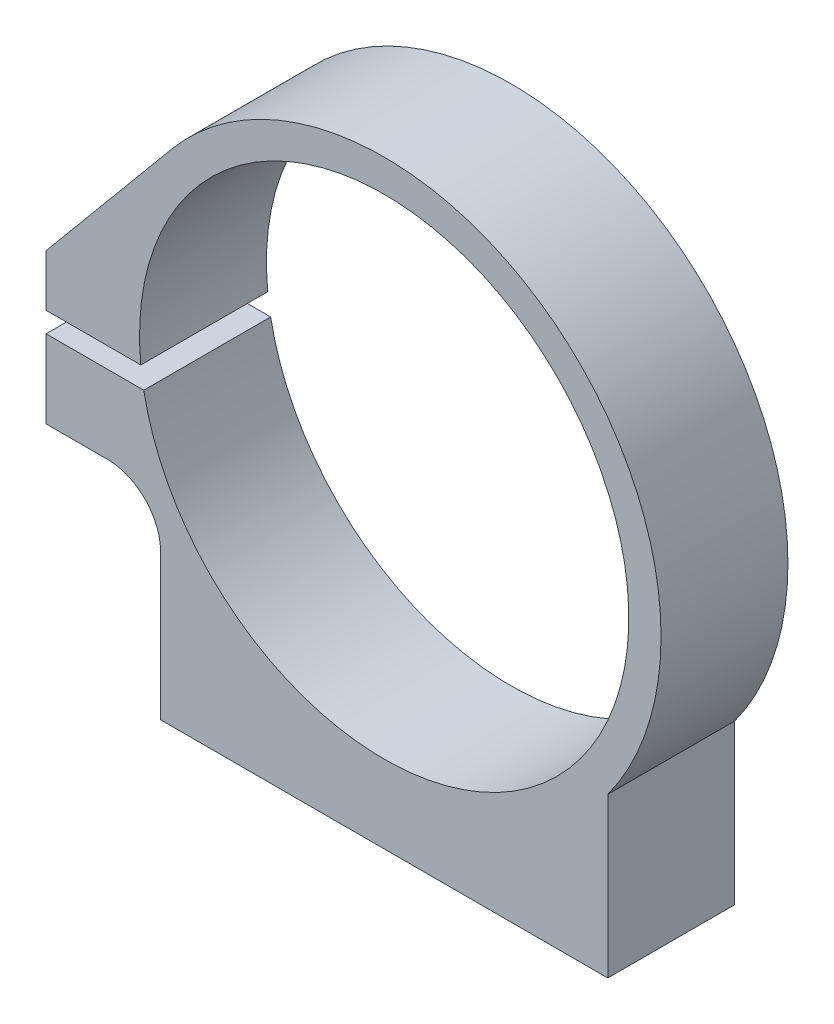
ISO-10303-21;
HEADER;
FILE_DESCRIPTION(('STEP AP214'),'2;1');
FILE_NAME('part.step','',(''),(''),'','','');
FILE_SCHEMA(('AUTOMOTIVE_DESIGN { 1 0 10303 214 1 1 1 1 }'));
ENDSEC;
DATA;
#1=APPLICATION_CONTEXT('core data for automotive mechanical design processes');
#2=APPLICATION_PROTOCOL_DEFINITION('international standard','automotive_design',2000,#1);
#3=PRODUCT_CONTEXT('',#1,'mechanical');
#4=PRODUCT('Part','Part','',(#3));
#5=PRODUCT_RELATED_PRODUCT_CATEGORY('part','',(#4));
#6=PRODUCT_DEFINITION_FORMATION('','',#4);
#7=PRODUCT_DEFINITION_CONTEXT('part definition',#1,'design');
#8=PRODUCT_DEFINITION('design','',#6,#7);
#9=PRODUCT_DEFINITION_SHAPE('','',#8);
#10=(LENGTH_UNIT() NAMED_UNIT(*) SI_UNIT(.MILLI.,.METRE.));
#11=(NAMED_UNIT(*) PLANE_ANGLE_UNIT() SI_UNIT($,.RADIAN.));
#12=(NAMED_UNIT(*) SI_UNIT($,.STERADIAN.) SOLID_ANGLE_UNIT());
#13=UNCERTAINTY_MEASURE_WITH_UNIT(LENGTH_MEASURE(1.E-05),#10,'distance_accuracy_value','');
#14=(GEOMETRIC_REPRESENTATION_CONTEXT(3) GLOBAL_UNCERTAINTY_ASSIGNED_CONTEXT((#13)) GLOBAL_UNIT_ASSIGNED_CONTEXT((#10,
#11,#12)) REPRESENTATION_CONTEXT('',''));
#15=CARTESIAN_POINT('',(0.,0.,0.));
#16=DIRECTION('',(0.,0.,1.));
#17=DIRECTION('',(1.,0.,0.));
#18=AXIS2_PLACEMENT_3D('',#15,#16,#17);
#19=CARTESIAN_POINT('',(-8.60422844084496E-13,-3.60822483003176E-13,50.8312898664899));
#20=DIRECTION('',(0.,0.,1.));
#21=DIRECTION('',(1.,0.,0.));
#22=AXIS2_PLACEMENT_3D('',#19,#20,#21);
#23=CYLINDRICAL_SURFACE('',#22,20.7264);
#24=CARTESIAN_POINT('',(-8.60422844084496E-13,-3.60822483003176E-13,60.3308898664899));
#25=DIRECTION('',(0.,0.,1.));
#26=DIRECTION('',(-1.,0.,0.));
#27=AXIS2_PLACEMENT_3D('',#24,#25,#26);
#28=CIRCLE('',#27,20.7264);
#29=CARTESIAN_POINT('',(16.7386,-12.2230490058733,60.3308898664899));
#30=VERTEX_POINT('',#29);
#31=CARTESIAN_POINT('',(-15.9273549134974,13.2628436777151,60.3308898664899));
#32=VERTEX_POINT('',#31);
#33=EDGE_CURVE('E156',#30,#32,#28,.T.);
#34=ORIENTED_EDGE('',*,*,#33,.F.);
#35=DIRECTION('',(0.,0.,1.));
#36=VECTOR('',#35,1.);
#37=CARTESIAN_POINT('',(16.7386,-12.2230490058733,50.8312898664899));
#38=LINE('',#37,#36);
#39=CARTESIAN_POINT('',(16.7386,-12.2230490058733,50.8312898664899));
#40=VERTEX_POINT('',#39);
#41=EDGE_CURVE('E11',#40,#30,#38,.T.);
#42=ORIENTED_EDGE('',*,*,#41,.F.);
#43=CARTESIAN_POINT('',(-8.60422844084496E-13,-3.60822483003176E-13,50.8312898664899));
#44=DIRECTION('',(0.,0.,1.));
#45=DIRECTION('',(-1.,0.,0.));
#46=AXIS2_PLACEMENT_3D('',#43,#44,#45);
#47=CIRCLE('',#46,20.7264);
#48=CARTESIAN_POINT('',(-15.9273549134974,13.2628436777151,50.8312898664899));
#49=VERTEX_POINT('',#48);
#50=EDGE_CURVE('E189',#40,#49,#47,.T.);
#51=ORIENTED_EDGE('',*,*,#50,.T.);
#52=DIRECTION('',(0.,0.,1.));
#53=VECTOR('',#52,1.);
#54=CARTESIAN_POINT('',(-15.9273549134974,13.2628436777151,50.8312898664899));
#55=LINE('',#54,#53);
#56=EDGE_CURVE('E38',#49,#32,#55,.T.);
#57=ORIENTED_EDGE('',*,*,#56,.T.);
#58=EDGE_LOOP('',(#34,#42,#51,#57));
#59=FACE_BOUND('',#58,.T.);
#60=ADVANCED_FACE('F35',(#59),#23,.T.);
#61=CARTESIAN_POINT('',(16.7386,-12.2230490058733,50.8312898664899));
#62=DIRECTION('',(1.,0.,0.));
#63=DIRECTION('',(0.,0.,-1.));
#64=AXIS2_PLACEMENT_3D('',#61,#62,#63);
#65=PLANE('',#64);
#66=DIRECTION('',(0.,1.,0.));
#67=VECTOR('',#66,1.);
#68=CARTESIAN_POINT('',(16.7386,-12.2230490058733,60.3308898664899));
#69=LINE('',#68,#67);
#70=CARTESIAN_POINT('',(16.7386,-24.13,60.3308898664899));
#71=VERTEX_POINT('',#70);
#72=EDGE_CURVE('E187',#71,#30,#69,.T.);
#73=ORIENTED_EDGE('',*,*,#72,.F.);
#74=DIRECTION('',(0.,0.,1.));
#75=VECTOR('',#74,1.);
#76=CARTESIAN_POINT('',(16.7386,-24.13,50.8312898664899));
#77=LINE('',#76,#75);
#78=CARTESIAN_POINT('',(16.7386,-24.13,50.8312898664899));
#79=VERTEX_POINT('',#78);
#80=EDGE_CURVE('E44',#79,#71,#77,.T.);
#81=ORIENTED_EDGE('',*,*,#80,.F.);
#82=DIRECTION('',(0.,1.,0.));
#83=VECTOR('',#82,1.);
#84=CARTESIAN_POINT('',(16.7386,-12.2230490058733,50.8312898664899));
#85=LINE('',#84,#83);
#86=EDGE_CURVE('E146',#79,#40,#85,.T.);
#87=ORIENTED_EDGE('',*,*,#86,.T.);
#88=ORIENTED_EDGE('',*,*,#41,.T.);
#89=EDGE_LOOP('',(#73,#81,#87,#88));
#90=FACE_BOUND('',#89,.T.);
#91=ADVANCED_FACE('F209',(#90),#65,.T.);
#92=CARTESIAN_POINT('',(16.7386,-24.13,50.8312898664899));
#93=DIRECTION('',(0.,-1.,0.));
#94=DIRECTION('',(0.,0.,-1.));
#95=AXIS2_PLACEMENT_3D('',#92,#93,#94);
#96=PLANE('',#95);
#97=CARTESIAN_POINT('',(13.55725,-24.13,55.5810898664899));
#98=DIRECTION('',(0.,-1.,0.));
#99=DIRECTION('',(0.,0.,-1.));
#100=AXIS2_PLACEMENT_3D('',#97,#98,#99);
#101=CIRCLE('',#100,1.47955);
#102=CARTESIAN_POINT('',(13.55725,-24.13,54.1015398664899));
#103=VERTEX_POINT('',#102);
#104=EDGE_CURVE('E279',#103,#103,#101,.T.);
#105=ORIENTED_EDGE('',*,*,#104,.F.);
#106=EDGE_LOOP('',(#105));
#107=FACE_BOUND('',#106,.T.);
#108=CARTESIAN_POINT('',(-13.55725,-24.13,55.5810898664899));
#109=DIRECTION('',(0.,-1.,0.));
#110=DIRECTION('',(0.,0.,-1.));
#111=AXIS2_PLACEMENT_3D('',#108,#109,#110);
#112=CIRCLE('',#111,1.47955);
#113=CARTESIAN_POINT('',(-13.55725,-24.13,54.1015398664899));
#114=VERTEX_POINT('',#113);
#115=EDGE_CURVE('E278',#114,#114,#112,.T.);
#116=ORIENTED_EDGE('',*,*,#115,.F.);
#117=EDGE_LOOP('',(#116));
#118=FACE_BOUND('',#117,.T.);
#119=DIRECTION('',(1.,0.,0.));
#120=VECTOR('',#119,1.);
#121=CARTESIAN_POINT('',(16.7386,-24.13,60.3308898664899));
#122=LINE('',#121,#120);
#123=CARTESIAN_POINT('',(-16.7386,-24.13,60.3308898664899));
#124=VERTEX_POINT('',#123);
#125=EDGE_CURVE('E133',#124,#71,#122,.T.);
#126=ORIENTED_EDGE('',*,*,#125,.F.);
#127=DIRECTION('',(0.,0.,1.));
#128=VECTOR('',#127,1.);
#129=CARTESIAN_POINT('',(-16.7386,-24.13,50.8312898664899));
#130=LINE('',#129,#128);
#131=CARTESIAN_POINT('',(-16.7386,-24.13,50.8312898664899));
#132=VERTEX_POINT('',#131);
#133=EDGE_CURVE('E128',#132,#124,#130,.T.);
#134=ORIENTED_EDGE('',*,*,#133,.F.);
#135=DIRECTION('',(1.,0.,0.));
#136=VECTOR('',#135,1.);
#137=CARTESIAN_POINT('',(16.7386,-24.13,50.8312898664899));
#138=LINE('',#137,#136);
#139=EDGE_CURVE('E131',#132,#79,#138,.T.);
#140=ORIENTED_EDGE('',*,*,#139,.T.);
#141=ORIENTED_EDGE('',*,*,#80,.T.);
#142=EDGE_LOOP('',(#126,#134,#140,#141));
#143=FACE_BOUND('',#142,.T.);
#144=ADVANCED_FACE('F130',(#107,#118,#143),#96,.T.);
#145=CARTESIAN_POINT('',(-16.7386,-24.13,50.8312898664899));
#146=DIRECTION('',(-1.,0.,0.));
#147=DIRECTION('',(0.,0.,1.));
#148=AXIS2_PLACEMENT_3D('',#145,#146,#147);
#149=PLANE('',#148);
#150=DIRECTION('',(0.,-1.,0.));
#151=VECTOR('',#150,1.);
#152=CARTESIAN_POINT('',(-16.7386,-24.13,60.3308898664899));
#153=LINE('',#152,#151);
#154=CARTESIAN_POINT('',(-16.7386,-13.2143497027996,60.3308898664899));
#155=VERTEX_POINT('',#154);
#156=EDGE_CURVE('E184',#155,#124,#153,.T.);
#157=ORIENTED_EDGE('',*,*,#156,.F.);
#158=DIRECTION('',(0.,0.,1.));
#159=VECTOR('',#158,1.);
#160=CARTESIAN_POINT('',(-16.7386,-13.2143497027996,50.8312898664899));
#161=LINE('',#160,#159);
#162=CARTESIAN_POINT('',(-16.7386,-13.2143497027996,50.8312898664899));
#163=VERTEX_POINT('',#162);
#164=EDGE_CURVE('E138',#163,#155,#161,.T.);
#165=ORIENTED_EDGE('',*,*,#164,.F.);
#166=DIRECTION('',(0.,-1.,0.));
#167=VECTOR('',#166,1.);
#168=CARTESIAN_POINT('',(-16.7386,-24.13,50.8312898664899));
#169=LINE('',#168,#167);
#170=EDGE_CURVE('E144',#163,#132,#169,.T.);
#171=ORIENTED_EDGE('',*,*,#170,.T.);
#172=ORIENTED_EDGE('',*,*,#133,.T.);
#173=EDGE_LOOP('',(#157,#165,#171,#172));
#174=FACE_BOUND('',#173,.T.);
#175=ADVANCED_FACE('F148',(#174),#149,.T.);
#176=CARTESIAN_POINT('',(-20.7200497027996,-13.2143497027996,50.8312898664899));
#177=DIRECTION('',(0.,0.,1.));
#178=DIRECTION('',(1.,0.,0.));
#179=AXIS2_PLACEMENT_3D('',#176,#177,#178);
#180=CYLINDRICAL_SURFACE('',#179,3.98144970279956);
#181=CARTESIAN_POINT('',(-20.7200497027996,-13.2143497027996,60.3308898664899));
#182=DIRECTION('',(0.,0.,-1.));
#183=DIRECTION('',(1.,0.,0.));
#184=AXIS2_PLACEMENT_3D('',#181,#182,#183);
#185=CIRCLE('',#184,3.98144970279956);
#186=CARTESIAN_POINT('',(-20.7200497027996,-9.2329,60.3308898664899));
#187=VERTEX_POINT('',#186);
#188=EDGE_CURVE('E181',#187,#155,#185,.T.);
#189=ORIENTED_EDGE('',*,*,#188,.F.);
#190=DIRECTION('',(0.,0.,1.));
#191=VECTOR('',#190,1.);
#192=CARTESIAN_POINT('',(-20.7200497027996,-9.2329,50.8312898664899));
#193=LINE('',#192,#191);
#194=CARTESIAN_POINT('',(-20.7200497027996,-9.2329,50.8312898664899));
#195=VERTEX_POINT('',#194);
#196=EDGE_CURVE('E193',#195,#187,#193,.T.);
#197=ORIENTED_EDGE('',*,*,#196,.F.);
#198=CARTESIAN_POINT('',(-20.7200497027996,-13.2143497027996,50.8312898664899));
#199=DIRECTION('',(0.,0.,-1.));
#200=DIRECTION('',(1.,0.,0.));
#201=AXIS2_PLACEMENT_3D('',#198,#199,#200);
#202=CIRCLE('',#201,3.98144970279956);
#203=EDGE_CURVE('E149',#195,#163,#202,.T.);
#204=ORIENTED_EDGE('',*,*,#203,.T.);
#205=ORIENTED_EDGE('',*,*,#164,.T.);
#206=EDGE_LOOP('',(#189,#197,#204,#205));
#207=FACE_BOUND('',#206,.T.);
#208=ADVANCED_FACE('F223',(#207),#180,.F.);
#209=CARTESIAN_POINT('',(-20.7200497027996,-9.2329,50.8312898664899));
#210=DIRECTION('',(0.,-1.,0.));
#211=DIRECTION('',(1.,0.,0.));
#212=AXIS2_PLACEMENT_3D('',#209,#210,#211);
#213=PLANE('',#212);
#214=DIRECTION('',(1.,0.,0.));
#215=VECTOR('',#214,1.);
#216=CARTESIAN_POINT('',(-20.7200497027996,-9.2329,60.3308898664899));
#217=LINE('',#216,#215);
#218=CARTESIAN_POINT('',(-25.3111000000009,-9.23290000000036,60.3308898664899));
#219=VERTEX_POINT('',#218);
#220=EDGE_CURVE('E178',#219,#187,#217,.T.);
#221=ORIENTED_EDGE('',*,*,#220,.F.);
#222=DIRECTION('',(0.,0.,1.));
#223=VECTOR('',#222,1.);
#224=CARTESIAN_POINT('',(-25.3111000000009,-9.23290000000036,50.8312898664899));
#225=LINE('',#224,#223);
#226=CARTESIAN_POINT('',(-25.3111000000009,-9.23290000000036,50.8312898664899));
#227=VERTEX_POINT('',#226);
#228=EDGE_CURVE('E195',#227,#219,#225,.T.);
#229=ORIENTED_EDGE('',*,*,#228,.F.);
#230=DIRECTION('',(1.,0.,0.));
#231=VECTOR('',#230,1.);
#232=CARTESIAN_POINT('',(-20.7200497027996,-9.2329,50.8312898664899));
#233=LINE('',#232,#231);
#234=EDGE_CURVE('E151',#227,#195,#233,.T.);
#235=ORIENTED_EDGE('',*,*,#234,.T.);
#236=ORIENTED_EDGE('',*,*,#196,.T.);
#237=EDGE_LOOP('',(#221,#229,#235,#236));
#238=FACE_BOUND('',#237,.T.);
#239=ADVANCED_FACE('F226',(#238),#213,.T.);
#240=CARTESIAN_POINT('',(-25.3111000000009,-9.23290000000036,50.8312898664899));
#241=DIRECTION('',(-1.,0.,0.));
#242=DIRECTION('',(0.,0.,1.));
#243=AXIS2_PLACEMENT_3D('',#240,#241,#242);
#244=PLANE('',#243);
#245=DIRECTION('',(0.,-1.,0.));
#246=VECTOR('',#245,1.);
#247=CARTESIAN_POINT('',(-25.3111000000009,-9.23290000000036,60.3308898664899));
#248=LINE('',#247,#246);
#249=CARTESIAN_POINT('',(-25.3111000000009,-3.39090000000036,60.3308898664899));
#250=VERTEX_POINT('',#249);
#251=EDGE_CURVE('E175',#250,#219,#248,.T.);
#252=ORIENTED_EDGE('',*,*,#251,.F.);
#253=DIRECTION('',(0.,0.,1.));
#254=VECTOR('',#253,1.);
#255=CARTESIAN_POINT('',(-25.3111000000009,-3.39090000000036,50.8312898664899));
#256=LINE('',#255,#254);
#257=CARTESIAN_POINT('',(-25.3111000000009,-3.39090000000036,50.8312898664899));
#258=VERTEX_POINT('',#257);
#259=EDGE_CURVE('E197',#258,#250,#256,.T.);
#260=ORIENTED_EDGE('',*,*,#259,.F.);
#261=DIRECTION('',(0.,-1.,0.));
#262=VECTOR('',#261,1.);
#263=CARTESIAN_POINT('',(-25.3111000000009,-9.23290000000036,50.8312898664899));
#264=LINE('',#263,#262);
#265=EDGE_CURVE('E303',#258,#227,#264,.T.);
#266=ORIENTED_EDGE('',*,*,#265,.T.);
#267=ORIENTED_EDGE('',*,*,#228,.T.);
#268=EDGE_LOOP('',(#252,#260,#266,#267));
#269=FACE_BOUND('',#268,.T.);
#270=ADVANCED_FACE('F230',(#269),#244,.T.);
#271=CARTESIAN_POINT('',(-25.3111000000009,-3.39090000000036,50.8312898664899));
#272=DIRECTION('',(0.,1.,0.));
#273=DIRECTION('',(0.,0.,1.));
#274=AXIS2_PLACEMENT_3D('',#271,#272,#273);
#275=PLANE('',#274);
#276=DIRECTION('',(-1.,0.,0.));
#277=VECTOR('',#276,1.);
#278=CARTESIAN_POINT('',(-25.3111000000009,-3.39090000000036,60.3308898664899));
#279=LINE('',#278,#277);
#280=CARTESIAN_POINT('',(-17.9967335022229,-3.39090000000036,60.3308898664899));
#281=VERTEX_POINT('',#280);
#282=EDGE_CURVE('E172',#281,#250,#279,.T.);
#283=ORIENTED_EDGE('',*,*,#282,.F.);
#284=DIRECTION('',(0.,0.,1.));
#285=VECTOR('',#284,1.);
#286=CARTESIAN_POINT('',(-17.9967335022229,-3.39090000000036,50.8312898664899));
#287=LINE('',#286,#285);
#288=CARTESIAN_POINT('',(-17.9967335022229,-3.39090000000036,50.8312898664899));
#289=VERTEX_POINT('',#288);
#290=EDGE_CURVE('E199',#289,#281,#287,.T.);
#291=ORIENTED_EDGE('',*,*,#290,.F.);
#292=DIRECTION('',(-1.,0.,0.));
#293=VECTOR('',#292,1.);
#294=CARTESIAN_POINT('',(-25.3111000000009,-3.39090000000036,50.8312898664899));
#295=LINE('',#294,#293);
#296=EDGE_CURVE('E300',#289,#258,#295,.T.);
#297=ORIENTED_EDGE('',*,*,#296,.T.);
#298=ORIENTED_EDGE('',*,*,#259,.T.);
#299=EDGE_LOOP('',(#283,#291,#297,#298));
#300=FACE_BOUND('',#299,.T.);
#301=ADVANCED_FACE('F234',(#300),#275,.T.);
#302=CARTESIAN_POINT('',(-8.60422844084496E-13,-3.60822483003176E-13,50.8312898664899));
#303=DIRECTION('',(0.,0.,1.));
#304=DIRECTION('',(1.,0.,0.));
#305=AXIS2_PLACEMENT_3D('',#302,#303,#304);
#306=CYLINDRICAL_SURFACE('',#305,18.3134);
#307=CARTESIAN_POINT('',(-8.60422844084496E-13,-3.60822483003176E-13,60.3308898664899));
#308=DIRECTION('',(0.,0.,-1.));
#309=DIRECTION('',(1.,0.,0.));
#310=AXIS2_PLACEMENT_3D('',#307,#308,#309);
#311=CIRCLE('',#310,18.3134);
#312=CARTESIAN_POINT('',(-18.2179939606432,-1.86690000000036,60.3308898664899));
#313=VERTEX_POINT('',#312);
#314=EDGE_CURVE('E169',#313,#281,#311,.T.);
#315=ORIENTED_EDGE('',*,*,#314,.F.);
#316=DIRECTION('',(0.,0.,1.));
#317=VECTOR('',#316,1.);
#318=CARTESIAN_POINT('',(-18.2179939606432,-1.86690000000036,50.8312898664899));
#319=LINE('',#318,#317);
#320=CARTESIAN_POINT('',(-18.2179939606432,-1.86690000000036,50.8312898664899));
#321=VERTEX_POINT('',#320);
#322=EDGE_CURVE('E201',#321,#313,#319,.T.);
#323=ORIENTED_EDGE('',*,*,#322,.F.);
#324=CARTESIAN_POINT('',(-8.60422844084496E-13,-3.60822483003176E-13,50.8312898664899));
#325=DIRECTION('',(0.,0.,-1.));
#326=DIRECTION('',(1.,0.,0.));
#327=AXIS2_PLACEMENT_3D('',#324,#325,#326);
#328=CIRCLE('',#327,18.3134);
#329=EDGE_CURVE('E297',#321,#289,#328,.T.);
#330=ORIENTED_EDGE('',*,*,#329,.T.);
#331=ORIENTED_EDGE('',*,*,#290,.T.);
#332=EDGE_LOOP('',(#315,#323,#330,#331));
#333=FACE_BOUND('',#332,.T.);
#334=ADVANCED_FACE('F238',(#333),#306,.F.);
#335=CARTESIAN_POINT('',(-18.2179939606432,-1.86690000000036,50.8312898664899));
#336=DIRECTION('',(0.,-1.,0.));
#337=DIRECTION('',(1.,0.,0.));
#338=AXIS2_PLACEMENT_3D('',#335,#336,#337);
#339=PLANE('',#338);
#340=DIRECTION('',(1.,0.,0.));
#341=VECTOR('',#340,1.);
#342=CARTESIAN_POINT('',(-18.2179939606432,-1.86690000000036,60.3308898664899));
#343=LINE('',#342,#341);
#344=CARTESIAN_POINT('',(-25.3111000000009,-1.86690000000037,60.3308898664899));
#345=VERTEX_POINT('',#344);
#346=EDGE_CURVE('E166',#345,#313,#343,.T.);
#347=ORIENTED_EDGE('',*,*,#346,.F.);
#348=DIRECTION('',(0.,0.,1.));
#349=VECTOR('',#348,1.);
#350=CARTESIAN_POINT('',(-25.3111000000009,-1.86690000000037,50.8312898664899));
#351=LINE('',#350,#349);
#352=CARTESIAN_POINT('',(-25.3111000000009,-1.86690000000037,50.8312898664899));
#353=VERTEX_POINT('',#352);
#354=EDGE_CURVE('E203',#353,#345,#351,.T.);
#355=ORIENTED_EDGE('',*,*,#354,.F.);
#356=DIRECTION('',(1.,0.,0.));
#357=VECTOR('',#356,1.);
#358=CARTESIAN_POINT('',(-18.2179939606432,-1.86690000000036,50.8312898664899));
#359=LINE('',#358,#357);
#360=EDGE_CURVE('E294',#353,#321,#359,.T.);
#361=ORIENTED_EDGE('',*,*,#360,.T.);
#362=ORIENTED_EDGE('',*,*,#322,.T.);
#363=EDGE_LOOP('',(#347,#355,#361,#362));
#364=FACE_BOUND('',#363,.T.);
#365=ADVANCED_FACE('F242',(#364),#339,.T.);
#366=CARTESIAN_POINT('',(-25.3111000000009,-1.86690000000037,50.8312898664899));
#367=DIRECTION('',(-1.,0.,0.));
#368=DIRECTION('',(0.,0.,1.));
#369=AXIS2_PLACEMENT_3D('',#366,#367,#368);
#370=PLANE('',#369);
#371=DIRECTION('',(0.,-1.,0.));
#372=VECTOR('',#371,1.);
#373=CARTESIAN_POINT('',(-25.3111000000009,-1.86690000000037,60.3308898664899));
#374=LINE('',#373,#372);
#375=CARTESIAN_POINT('',(-25.3111000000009,1.99389999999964,60.3308898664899));
#376=VERTEX_POINT('',#375);
#377=EDGE_CURVE('E163',#376,#345,#374,.T.);
#378=ORIENTED_EDGE('',*,*,#377,.F.);
#379=DIRECTION('',(0.,0.,1.));
#380=VECTOR('',#379,1.);
#381=CARTESIAN_POINT('',(-25.3111000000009,1.99389999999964,50.8312898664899));
#382=LINE('',#381,#380);
#383=CARTESIAN_POINT('',(-25.3111000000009,1.99389999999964,50.8312898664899));
#384=VERTEX_POINT('',#383);
#385=EDGE_CURVE('E204',#384,#376,#382,.T.);
#386=ORIENTED_EDGE('',*,*,#385,.F.);
#387=DIRECTION('',(0.,-1.,0.));
#388=VECTOR('',#387,1.);
#389=CARTESIAN_POINT('',(-25.3111000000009,-1.86690000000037,50.8312898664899));
#390=LINE('',#389,#388);
#391=EDGE_CURVE('E291',#384,#353,#390,.T.);
#392=ORIENTED_EDGE('',*,*,#391,.T.);
#393=ORIENTED_EDGE('',*,*,#354,.T.);
#394=EDGE_LOOP('',(#378,#386,#392,#393));
#395=FACE_BOUND('',#394,.T.);
#396=ADVANCED_FACE('F246',(#395),#370,.T.);
#397=CARTESIAN_POINT('',(-25.3111000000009,1.99389999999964,50.8312898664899));
#398=DIRECTION('',(-0.768457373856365,0.639900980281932,0.));
#399=DIRECTION('',(-0.639900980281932,-0.768457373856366,0.));
#400=AXIS2_PLACEMENT_3D('',#397,#398,#399);
#401=PLANE('',#400);
#402=DIRECTION('',(-0.639900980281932,-0.768457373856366,0.));
#403=VECTOR('',#402,1.);
#404=CARTESIAN_POINT('',(-25.3111000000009,1.99389999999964,60.3308898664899));
#405=LINE('',#404,#403);
#406=EDGE_CURVE('E159',#32,#376,#405,.T.);
#407=ORIENTED_EDGE('',*,*,#406,.F.);
#408=ORIENTED_EDGE('',*,*,#56,.F.);
#409=DIRECTION('',(-0.639900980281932,-0.768457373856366,0.));
#410=VECTOR('',#409,1.);
#411=CARTESIAN_POINT('',(-25.3111000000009,1.99389999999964,50.8312898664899));
#412=LINE('',#411,#410);
#413=EDGE_CURVE('E289',#49,#384,#412,.T.);
#414=ORIENTED_EDGE('',*,*,#413,.T.);
#415=ORIENTED_EDGE('',*,*,#385,.T.);
#416=EDGE_LOOP('',(#407,#408,#414,#415));
#417=FACE_BOUND('',#416,.T.);
#418=ADVANCED_FACE('F206',(#417),#401,.T.);
#419=CARTESIAN_POINT('',(-8.60422844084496E-13,-3.60822483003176E-13,50.8312898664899));
#420=DIRECTION('',(0.,0.,-1.));
#421=DIRECTION('',(-1.,0.,0.));
#422=AXIS2_PLACEMENT_3D('',#419,#420,#421);
#423=PLANE('',#422);
#424=ORIENTED_EDGE('',*,*,#50,.F.);
#425=ORIENTED_EDGE('',*,*,#86,.F.);
#426=ORIENTED_EDGE('',*,*,#139,.F.);
#427=ORIENTED_EDGE('',*,*,#170,.F.);
#428=ORIENTED_EDGE('',*,*,#203,.F.);
#429=ORIENTED_EDGE('',*,*,#234,.F.);
#430=ORIENTED_EDGE('',*,*,#265,.F.);
#431=ORIENTED_EDGE('',*,*,#296,.F.);
#432=ORIENTED_EDGE('',*,*,#329,.F.);
#433=ORIENTED_EDGE('',*,*,#360,.F.);
#434=ORIENTED_EDGE('',*,*,#391,.F.);
#435=ORIENTED_EDGE('',*,*,#413,.F.);
#436=EDGE_LOOP('',(#424,#425,#426,#427,#428,#429,#430,#431,#432,#433,#434,#435));
#437=FACE_BOUND('',#436,.T.);
#438=ADVANCED_FACE('F142',(#437),#423,.T.);
#439=CARTESIAN_POINT('',(-8.60422844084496E-13,-3.60822483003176E-13,60.3308898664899));
#440=DIRECTION('',(0.,0.,-1.));
#441=DIRECTION('',(-1.,0.,0.));
#442=AXIS2_PLACEMENT_3D('',#439,#440,#441);
#443=PLANE('',#442);
#444=ORIENTED_EDGE('',*,*,#33,.T.);
#445=ORIENTED_EDGE('',*,*,#406,.T.);
#446=ORIENTED_EDGE('',*,*,#377,.T.);
#447=ORIENTED_EDGE('',*,*,#346,.T.);
#448=ORIENTED_EDGE('',*,*,#314,.T.);
#449=ORIENTED_EDGE('',*,*,#282,.T.);
#450=ORIENTED_EDGE('',*,*,#251,.T.);
#451=ORIENTED_EDGE('',*,*,#220,.T.);
#452=ORIENTED_EDGE('',*,*,#188,.T.);
#453=ORIENTED_EDGE('',*,*,#156,.T.);
#454=ORIENTED_EDGE('',*,*,#125,.T.);
#455=ORIENTED_EDGE('',*,*,#72,.T.);
#456=EDGE_LOOP('',(#444,#445,#446,#447,#448,#449,#450,#451,#452,#453,#454,#455));
#457=FACE_BOUND('',#456,.T.);
#458=ADVANCED_FACE('F208',(#457),#443,.F.);
#459=CARTESIAN_POINT('',(-13.55725,-17.78,55.5810898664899));
#460=DIRECTION('',(0.,-1.,0.));
#461=DIRECTION('',(0.,0.,-1.));
#462=AXIS2_PLACEMENT_3D('',#459,#460,#461);
#463=CYLINDRICAL_SURFACE('',#462,1.47955);
#464=CARTESIAN_POINT('',(-13.55725,-17.78,55.5810898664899));
#465=DIRECTION('',(0.,-1.,0.));
#466=DIRECTION('',(0.,0.,-1.));
#467=AXIS2_PLACEMENT_3D('',#464,#465,#466);
#468=CIRCLE('',#467,1.47955);
#469=CARTESIAN_POINT('',(-13.55725,-17.78,54.1015398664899));
#470=VERTEX_POINT('',#469);
#471=EDGE_CURVE('E160',#470,#470,#468,.T.);
#472=ORIENTED_EDGE('',*,*,#471,.F.);
#473=EDGE_LOOP('',(#472));
#474=FACE_BOUND('',#473,.T.);
#475=ORIENTED_EDGE('',*,*,#115,.T.);
#476=EDGE_LOOP('',(#475));
#477=FACE_BOUND('',#476,.T.);
#478=ADVANCED_FACE('F257',(#474,#477),#463,.F.);
#479=CARTESIAN_POINT('',(-13.55725,-17.78,55.5810898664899));
#480=DIRECTION('',(0.,-1.,0.));
#481=DIRECTION('',(0.,0.,-1.));
#482=AXIS2_PLACEMENT_3D('',#479,#480,#481);
#483=PLANE('',#482);
#484=ORIENTED_EDGE('',*,*,#471,.T.);
#485=EDGE_LOOP('',(#484));
#486=FACE_BOUND('',#485,.T.);
#487=ADVANCED_FACE('F261',(#486),#483,.T.);
#488=CARTESIAN_POINT('',(13.55725,-17.78,55.5810898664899));
#489=DIRECTION('',(0.,-1.,0.));
#490=DIRECTION('',(0.,0.,-1.));
#491=AXIS2_PLACEMENT_3D('',#488,#489,#490);
#492=CYLINDRICAL_SURFACE('',#491,1.47955);
#493=CARTESIAN_POINT('',(13.55725,-17.78,55.5810898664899));
#494=DIRECTION('',(0.,-1.,0.));
#495=DIRECTION('',(0.,0.,-1.));
#496=AXIS2_PLACEMENT_3D('',#493,#494,#495);
#497=CIRCLE('',#496,1.47955);
#498=CARTESIAN_POINT('',(13.55725,-17.78,54.1015398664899));
#499=VERTEX_POINT('',#498);
#500=EDGE_CURVE('E277',#499,#499,#497,.T.);
#501=ORIENTED_EDGE('',*,*,#500,.F.);
#502=EDGE_LOOP('',(#501));
#503=FACE_BOUND('',#502,.T.);
#504=ORIENTED_EDGE('',*,*,#104,.T.);
#505=EDGE_LOOP('',(#504));
#506=FACE_BOUND('',#505,.T.);
#507=ADVANCED_FACE('F265',(#503,#506),#492,.F.);
#508=CARTESIAN_POINT('',(13.55725,-17.78,55.5810898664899));
#509=DIRECTION('',(0.,-1.,0.));
#510=DIRECTION('',(0.,0.,-1.));
#511=AXIS2_PLACEMENT_3D('',#508,#509,#510);
#512=PLANE('',#511);
#513=ORIENTED_EDGE('',*,*,#500,.T.);
#514=EDGE_LOOP('',(#513));
#515=FACE_BOUND('',#514,.T.);
#516=ADVANCED_FACE('F269',(#515),#512,.T.);
#517=CLOSED_SHELL('',(#60,#91,#144,#175,#208,#239,#270,#301,#334,#365,#396,#418,#438,#458,#478,
#487,#507,#516));
#518=MANIFOLD_SOLID_BREP('B2',#517);
#519=ADVANCED_BREP_SHAPE_REPRESENTATION('',(#18,#518),#14);
#520=SHAPE_DEFINITION_REPRESENTATION(#9,#519);
ENDSEC;
END-ISO-10303-21;
